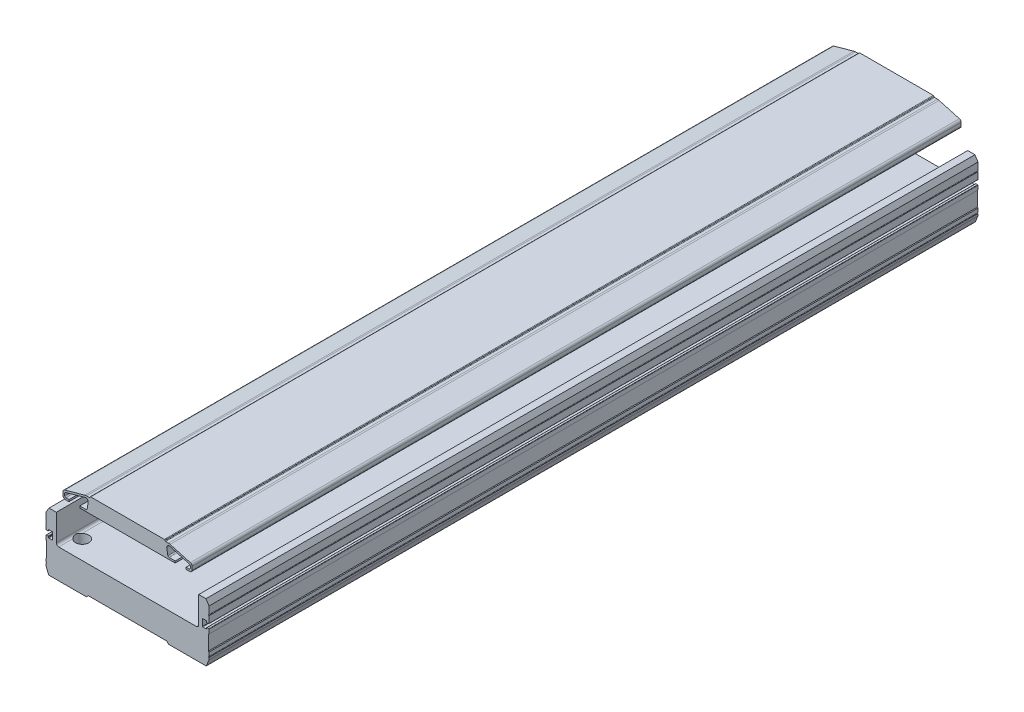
from build123d import *

# Parameters (mm, degrees)
EXTRUDE_1_DEPTH             = 637
EXTRUDE_1_2_DEPTH           = 637
HOLE_WIZARD_1_AT_2_COUNT    = 2
HOLE_WIZARD_1_AT_2_PITCH    = 106
HOLE_WIZARD_1_AT_3_COUNT    = 2
HOLE_WIZARD_1_AT_3_PITCH    = 183.673623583
HOLE_WIZARD_1_AT_4_COUNT    = 2
HOLE_WIZARD_1_AT_4_PITCH    = 150
HOLE_WIZARD_1_AT_5_COUNT    = 2
HOLE_WIZARD_1_AT_5_PITCH    = 365.699330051
HOLE_WIZARD_1_AT_6_COUNT    = 2
HOLE_WIZARD_1_AT_6_PITCH    = 350
HOLE_WIZARD_1_AT_7_COUNT    = 2
HOLE_WIZARD_1_AT_7_PITCH    = 560.121415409
HOLE_WIZARD_1_AT_8_COUNT    = 2
HOLE_WIZARD_1_AT_8_PITCH    = 550
HOLE_WIZARD_M6_0_AT_2_COUNT = 2
HOLE_WIZARD_M6_0_AT_2_PITCH = 106
HOLE_WIZARD_M6_0_AT_3_COUNT = 2
HOLE_WIZARD_M6_0_AT_3_PITCH = 150
HOLE_WIZARD_M6_0_AT_4_COUNT = 2
HOLE_WIZARD_M6_0_AT_4_PITCH = 183.673623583
HOLE_WIZARD_M6_0_AT_5_COUNT = 2
HOLE_WIZARD_M6_0_AT_5_PITCH = 365.699330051
HOLE_WIZARD_M6_0_AT_6_COUNT = 2
HOLE_WIZARD_M6_0_AT_6_PITCH = 350
HOLE_WIZARD_M6_0_AT_7_COUNT = 2
HOLE_WIZARD_M6_0_AT_7_PITCH = 560.121415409
HOLE_WIZARD_M6_0_AT_8_COUNT = 2
HOLE_WIZARD_M6_0_AT_8_PITCH = 550


with BuildPart() as part:
    # Sketch 1 → Extrude 1 (new body)
    with BuildSketch(Plane.XY):
        with BuildLine():
            Line((-39.5, 59.4), (39.5, 59.4))
            Line((39.5, 59.4), (39.5, 60.9))
            Line((39.5, 60.9), (34.4, 60.9))
            ThreePointArc((34.4, 60.9), (33.754110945, 61.136568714), (33.413816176, 61.734345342))
            Line((33.413816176, 61.734345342), (32.536146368, 66.959334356))
            ThreePointArc((32.536146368, 66.959334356), (33.171932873, 68.778444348), (35.048529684, 69.216359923))
            Line((35.048529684, 69.216359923), (51.270007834, 64.667479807))
            ThreePointArc((51.270007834, 64.667479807), (51.79687133, 64.308770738), (52, 63.704621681))
            Line((52, 63.704621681), (52, 61.9))
            ThreePointArc((52, 61.9), (51.707106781, 61.192893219), (51, 60.9))
            Line((51, 60.9), (48.5, 60.9))
            Line((48.5, 60.9), (48.5, 59.4))
            Line((48.5, 59.4), (51.5, 59.4))
            ThreePointArc((51.5, 59.4), (52.914213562, 59.985786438), (53.5, 61.4))
            Line((53.5, 61.4), (53.5, 64.083697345))
            ThreePointArc((53.5, 64.083697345), (53.093742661, 65.291995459), (52.040015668, 66.009413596))
            Line((52.040015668, 66.009413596), (35.262246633, 70.714290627))
            ThreePointArc((35.262246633, 70.714290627), (34.593583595, 70.853355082), (33.912207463, 70.9))
            Line((33.912207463, 70.9), (31.5, 70.9))
            ThreePointArc((31.5, 70.9), (31.146446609, 71.046446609), (31, 71.4))
            ThreePointArc((31, 71.4), (30.853553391, 71.753553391), (30.5, 71.9))
            Line((30.5, 71.9), (-30.5, 71.9))
            ThreePointArc((-30.5, 71.9), (-30.853553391, 71.753553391), (-31, 71.4))
            ThreePointArc((-31, 71.4), (-31.146446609, 71.046446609), (-31.5, 70.9))
            Line((-31.5, 70.9), (-33.912207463, 70.9))
            ThreePointArc((-33.912207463, 70.9), (-34.593583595, 70.853355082), (-35.262246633, 70.714290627))
            Line((-35.262246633, 70.714290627), (-52.040015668, 66.009413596))
            ThreePointArc((-52.040015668, 66.009413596), (-53.093742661, 65.291995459), (-53.5, 64.083697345))
            Line((-53.5, 64.083697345), (-53.5, 61.4))
            ThreePointArc((-53.5, 61.4), (-52.914213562, 59.985786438), (-51.5, 59.4))
            Line((-51.5, 59.4), (-48.5, 59.4))
            Line((-48.5, 59.4), (-48.5, 60.9))
            Line((-48.5, 60.9), (-51, 60.9))
            ThreePointArc((-51, 60.9), (-51.707106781, 61.192893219), (-52, 61.9))
            Line((-52, 61.9), (-52, 63.704621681))
            ThreePointArc((-52, 63.704621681), (-51.79687133, 64.308770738), (-51.270007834, 64.667479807))
            Line((-51.270007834, 64.667479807), (-35.048529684, 69.216359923))
            ThreePointArc((-35.048529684, 69.216359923), (-33.171932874, 68.778444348), (-32.536146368, 66.959334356))
            Line((-32.536146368, 66.959334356), (-33.413816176, 61.734345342))
            ThreePointArc((-33.413816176, 61.734345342), (-33.754110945, 61.136568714), (-34.4, 60.9))
            Line((-34.4, 60.9), (-39.5, 60.9))
            Line((-39.5, 60.9), (-39.5, 59.4))
        make_face()
    extrude(amount=-EXTRUDE_1_DEPTH)


with BuildPart() as body_2:
    # Sketch 1 → Extrude 1 2 (new body)
    with BuildSketch(Plane.XY):
        with BuildLine():
            Line((-67, 22), (-67, 10))
            Line((-67, 10), (-67.5, 9.5))
            Line((-67.5, 9.5), (-67.5, 6.375))
            ThreePointArc((-67.5, 6.375), (-67.125, 6), (-67.5, 5.625))
            Line((-67.5, 5.625), (-67.49999984, 4.381168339))
            ThreePointArc((-67.49999984, 4.381168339), (-67.464614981, 4.007418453), (-67.360006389, 3.646865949))
            Line((-67.360006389, 3.646865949), (-65.506419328, -1.028852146))
            ThreePointArc((-65.506419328, -1.028852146), (-65.35722349, -1.328991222), (-65.16, -1.6))
            Line((-65.16, -1.6), (-34.1, -1.6))
            Line((-34.1, -1.6), (-32.5, 0))
            Line((-32.5, 0), (32.5, 0))
            Line((32.5, 0), (34.1, -1.6))
            Line((34.1, -1.6), (65.16, -1.6))
            ThreePointArc((65.16, -1.6), (65.35722349, -1.328991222), (65.506419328, -1.028852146))
            Line((65.506419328, -1.028852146), (67.360006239, 3.646865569))
            ThreePointArc((67.360006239, 3.646865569), (67.464614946, 4.007418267), (67.499999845, 4.381168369))
            Line((67.499999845, 4.381168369), (67.499999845, 5.625000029))
            ThreePointArc((67.499999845, 5.625000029), (67.124999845, 6.000000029), (67.499999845, 6.375000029))
            Line((67.499999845, 6.375000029), (67.499999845, 9.500000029))
            Line((67.499999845, 9.500000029), (66.999999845, 10.000000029))
            Line((66.999999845, 10.000000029), (66.999999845, 22.000000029))
            Line((66.999999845, 22.000000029), (67.499999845, 22.500000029))
            Line((67.499999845, 22.500000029), (67.499999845, 25.900000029))
            ThreePointArc((67.499999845, 25.900000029), (67.41213188, 26.112132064), (67.199999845, 26.200000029))
            Line((67.199999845, 26.200000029), (65.799999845, 26.200000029))
            ThreePointArc((65.799999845, 26.200000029), (65.587867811, 26.112132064), (65.499999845, 25.900000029))
            Line((65.499999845, 25.900000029), (65.499999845, 25.300000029))
            ThreePointArc((65.499999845, 25.300000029), (65.41213188, 25.087867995), (65.199999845, 25.000000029))
            Line((65.199999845, 25.000000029), (62.299999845, 25.000000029))
            ThreePointArc((62.299999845, 25.000000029), (62.087867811, 25.087867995), (61.999999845, 25.300000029))
            Line((61.999999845, 25.300000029), (61.999999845, 30.700000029))
            ThreePointArc((61.999999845, 30.700000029), (62.087867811, 30.912132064), (62.299999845, 31.000000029))
            Line((62.299999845, 31.000000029), (65.199999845, 31.000000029))
            ThreePointArc((65.199999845, 31.000000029), (65.41213188, 30.912132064), (65.499999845, 30.700000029))
            Line((65.499999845, 30.700000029), (65.499999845, 30.100000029))
            ThreePointArc((65.499999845, 30.100000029), (65.587867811, 29.887867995), (65.799999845, 29.800000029))
            Line((65.799999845, 29.800000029), (67.199999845, 29.800000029))
            ThreePointArc((67.199999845, 29.800000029), (67.41213188, 29.887867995), (67.499999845, 30.100000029))
            Line((67.499999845, 30.100000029), (67.499999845, 35.625000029))
            ThreePointArc((67.499999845, 35.625000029), (67.124999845, 36.000000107), (67.5, 36.375000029))
            Line((67.5, 36.375000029), (67.5, 42.6))
            Line((67.5, 42.6), (65, 46.6))
            Line((65, 46.6), (59, 46.6))
            Line((59, 46.6), (59, 24.7))
            ThreePointArc((59, 24.7), (58.414213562, 23.285786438), (57, 22.7))
            Line((57, 22.7), (-57, 22.7))
            ThreePointArc((-57, 22.7), (-58.414213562, 23.285786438), (-59, 24.7))
            Line((-59, 24.7), (-59, 46.6))
            Line((-59, 46.6), (-65, 46.6))
            Line((-65, 46.6), (-67.5, 42.6))
            Line((-67.5, 42.6), (-67.5, 36.375))
            ThreePointArc((-67.5, 36.375), (-67.125, 36), (-67.5, 35.625))
            Line((-67.5, 35.625), (-67.5, 30.1))
            ThreePointArc((-67.5, 30.1), (-67.412132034, 29.887867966), (-67.2, 29.8))
            Line((-67.2, 29.8), (-65.8, 29.8))
            ThreePointArc((-65.8, 29.8), (-65.587867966, 29.887867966), (-65.5, 30.1))
            Line((-65.5, 30.1), (-65.5, 30.7))
            ThreePointArc((-65.5, 30.7), (-65.412132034, 30.912132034), (-65.2, 31))
            Line((-65.2, 31), (-62.3, 31))
            ThreePointArc((-62.3, 31), (-62.087867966, 30.912132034), (-62, 30.7))
            Line((-62, 30.7), (-62, 25.3))
            ThreePointArc((-62, 25.3), (-62.087867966, 25.087867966), (-62.3, 25))
            Line((-62.3, 25), (-65.2, 25))
            ThreePointArc((-65.2, 25), (-65.412132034, 25.087867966), (-65.5, 25.3))
            Line((-65.5, 25.3), (-65.5, 25.9))
            ThreePointArc((-65.5, 25.9), (-65.587867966, 26.112132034), (-65.8, 26.2))
            Line((-65.8, 26.2), (-67.2, 26.2))
            ThreePointArc((-67.2, 26.2), (-67.412132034, 26.112132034), (-67.5, 25.9))
            Line((-67.5, 25.9), (-67.5, 22.5))
            Line((-67.5, 22.5), (-67, 22))
        make_face()
    extrude(amount=-EXTRUDE_1_2_DEPTH)

    # Sketch 4 → Hole Wizard 1 (revolve, cut)
    with BuildSketch(Plane(origin=(-53, 46.6, -565.5), x_dir=(0, 0, 1), z_dir=(1, 0, 0))):
        Polygon((0, 0), (0, 48.2), (3.5, 48.2), (3.5, 41), (5.5, 41), (5.5, 0), align=None)
    hole_wizard_1 = revolve(axis=Axis((-53, 52.95, -565.5), (0, -1, 0)), mode=Mode.SUBTRACT)

    # Hole Wizard 1 at 2: Hole Wizard 1 ×2
    with Locations(*[(i * HOLE_WIZARD_1_AT_2_PITCH, 0, 0) for i in range(1, HOLE_WIZARD_1_AT_2_COUNT)]):
        add(hole_wizard_1, mode=Mode.SUBTRACT)

    # Hole Wizard 1 at 3: Hole Wizard 1 ×2
    with Locations(*[Vector(0.5771106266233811, 1.14802786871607e-13, 0.8166659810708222) * (i * HOLE_WIZARD_1_AT_3_PITCH) for i in range(1, HOLE_WIZARD_1_AT_3_COUNT)]):
        add(hole_wizard_1, mode=Mode.SUBTRACT)

    # Hole Wizard 1 at 4: Hole Wizard 1 ×2
    with Locations(*[(0, 0, i * HOLE_WIZARD_1_AT_4_PITCH) for i in range(1, HOLE_WIZARD_1_AT_4_COUNT)]):
        add(hole_wizard_1, mode=Mode.SUBTRACT)

    # Hole Wizard 1 at 5: Hole Wizard 1 ×2
    with Locations(*[Vector(0.2898556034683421, 5.766005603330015e-14, 0.9570703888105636) * (i * HOLE_WIZARD_1_AT_5_PITCH) for i in range(1, HOLE_WIZARD_1_AT_5_COUNT)]):
        add(hole_wizard_1, mode=Mode.SUBTRACT)

    # Hole Wizard 1 at 6: Hole Wizard 1 ×2
    with Locations(*[(0, 0, i * HOLE_WIZARD_1_AT_6_PITCH) for i in range(1, HOLE_WIZARD_1_AT_6_COUNT)]):
        add(hole_wizard_1, mode=Mode.SUBTRACT)

    # Hole Wizard 1 at 7: Hole Wizard 1 ×2
    with Locations(*[Vector(0.18924468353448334, 3.76458447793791e-14, 0.9819299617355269) * (i * HOLE_WIZARD_1_AT_7_PITCH) for i in range(1, HOLE_WIZARD_1_AT_7_COUNT)]):
        add(hole_wizard_1, mode=Mode.SUBTRACT)

    # Hole Wizard 1 at 8: Hole Wizard 1 ×2
    with Locations(*[(0, 0, i * HOLE_WIZARD_1_AT_8_PITCH) for i in range(1, HOLE_WIZARD_1_AT_8_COUNT)]):
        add(hole_wizard_1, mode=Mode.SUBTRACT)

    # Sketch 6 → Hole Wizard M6 _0 (revolve, cut)
    with BuildSketch(Plane(origin=(-53, -1.6, -575.5), x_dir=(0, 0, -1), z_dir=(1, 0, 0))):
        Polygon((0, 0), (0, 16.502151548), (2.5, 15), (2.5, 0), align=None)
    hole_wizard_m6_0 = revolve(axis=Axis((-53, -7.95, -575.5), (0, 1, 0)), mode=Mode.SUBTRACT)

    # Hole Wizard M6 _0 at 2: Hole Wizard M6 _0 ×2
    with Locations(*[(i * HOLE_WIZARD_M6_0_AT_2_PITCH, 0, 0) for i in range(1, HOLE_WIZARD_M6_0_AT_2_COUNT)]):
        add(hole_wizard_m6_0, mode=Mode.SUBTRACT)

    # Hole Wizard M6 _0 at 3: Hole Wizard M6 _0 ×2
    with Locations(*[(0, 0, i * HOLE_WIZARD_M6_0_AT_3_PITCH) for i in range(1, HOLE_WIZARD_M6_0_AT_3_COUNT)]):
        add(hole_wizard_m6_0, mode=Mode.SUBTRACT)

    # Hole Wizard M6 _0 at 4: Hole Wizard M6 _0 ×2
    with Locations(*[Vector(0.5771106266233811, 0, 0.8166659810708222) * (i * HOLE_WIZARD_M6_0_AT_4_PITCH) for i in range(1, HOLE_WIZARD_M6_0_AT_4_COUNT)]):
        add(hole_wizard_m6_0, mode=Mode.SUBTRACT)

    # Hole Wizard M6 _0 at 5: Hole Wizard M6 _0 ×2
    with Locations(*[Vector(0.2898556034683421, 0, 0.9570703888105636) * (i * HOLE_WIZARD_M6_0_AT_5_PITCH) for i in range(1, HOLE_WIZARD_M6_0_AT_5_COUNT)]):
        add(hole_wizard_m6_0, mode=Mode.SUBTRACT)

    # Hole Wizard M6 _0 at 6: Hole Wizard M6 _0 ×2
    with Locations(*[(0, 0, i * HOLE_WIZARD_M6_0_AT_6_PITCH) for i in range(1, HOLE_WIZARD_M6_0_AT_6_COUNT)]):
        add(hole_wizard_m6_0, mode=Mode.SUBTRACT)

    # Hole Wizard M6 _0 at 7: Hole Wizard M6 _0 ×2
    with Locations(*[Vector(0.18924468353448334, 0, 0.9819299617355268) * (i * HOLE_WIZARD_M6_0_AT_7_PITCH) for i in range(1, HOLE_WIZARD_M6_0_AT_7_COUNT)]):
        add(hole_wizard_m6_0, mode=Mode.SUBTRACT)

    # Hole Wizard M6 _0 at 8: Hole Wizard M6 _0 ×2
    with Locations(*[(0, 0, i * HOLE_WIZARD_M6_0_AT_8_PITCH) for i in range(1, HOLE_WIZARD_M6_0_AT_8_COUNT)]):
        add(hole_wizard_m6_0, mode=Mode.SUBTRACT)


solid = Compound([part.part, body_2.part])
